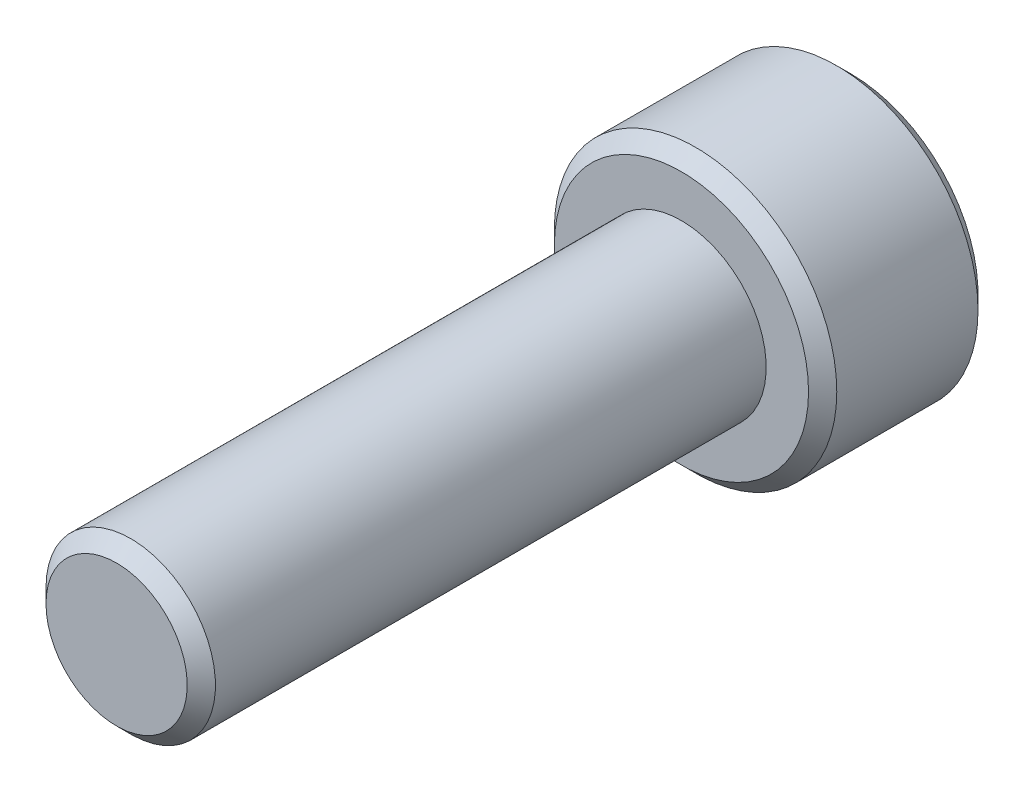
ISO-10303-21;
HEADER;
FILE_DESCRIPTION(('STEP AP214'),'2;1');
FILE_NAME('part.step','',(''),(''),'','','');
FILE_SCHEMA(('AUTOMOTIVE_DESIGN { 1 0 10303 214 1 1 1 1 }'));
ENDSEC;
DATA;
#1=APPLICATION_CONTEXT('core data for automotive mechanical design processes');
#2=APPLICATION_PROTOCOL_DEFINITION('international standard','automotive_design',2000,#1);
#3=PRODUCT_CONTEXT('',#1,'mechanical');
#4=PRODUCT('Part','Part','',(#3));
#5=PRODUCT_RELATED_PRODUCT_CATEGORY('part','',(#4));
#6=PRODUCT_DEFINITION_FORMATION('','',#4);
#7=PRODUCT_DEFINITION_CONTEXT('part definition',#1,'design');
#8=PRODUCT_DEFINITION('design','',#6,#7);
#9=PRODUCT_DEFINITION_SHAPE('','',#8);
#10=(LENGTH_UNIT() NAMED_UNIT(*) SI_UNIT(.MILLI.,.METRE.));
#11=(NAMED_UNIT(*) PLANE_ANGLE_UNIT() SI_UNIT($,.RADIAN.));
#12=(NAMED_UNIT(*) SI_UNIT($,.STERADIAN.) SOLID_ANGLE_UNIT());
#13=UNCERTAINTY_MEASURE_WITH_UNIT(LENGTH_MEASURE(1.E-05),#10,'distance_accuracy_value','');
#14=(GEOMETRIC_REPRESENTATION_CONTEXT(3) GLOBAL_UNCERTAINTY_ASSIGNED_CONTEXT((#13)) GLOBAL_UNIT_ASSIGNED_CONTEXT((#10,
#11,#12)) REPRESENTATION_CONTEXT('',''));
#15=CARTESIAN_POINT('',(0.,0.,0.));
#16=DIRECTION('',(0.,0.,1.));
#17=DIRECTION('',(1.,0.,0.));
#18=AXIS2_PLACEMENT_3D('',#15,#16,#17);
#19=CARTESIAN_POINT('',(-2.5,-1.443375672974,-22.25));
#20=DIRECTION('',(-1.,0.,0.));
#21=DIRECTION('',(0.,0.,1.));
#22=AXIS2_PLACEMENT_3D('',#19,#20,#21);
#23=PLANE('',#22);
#24=DIRECTION('',(0.,1.,0.));
#25=VECTOR('',#24,1.);
#26=CARTESIAN_POINT('',(-2.5,0.,-22.25));
#27=LINE('',#26,#25);
#28=CARTESIAN_POINT('',(-2.49999999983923,1.44337567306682,-22.25));
#29=VERTEX_POINT('',#28);
#30=CARTESIAN_POINT('',(-2.49999999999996,-1.44337567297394,-22.25));
#31=VERTEX_POINT('',#30);
#32=EDGE_CURVE('E172',#29,#31,#27,.F.);
#33=ORIENTED_EDGE('',*,*,#32,.T.);
#34=DIRECTION('',(0.,0.,1.));
#35=VECTOR('',#34,1.);
#36=CARTESIAN_POINT('',(-2.49999999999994,-1.4433756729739,-22.25));
#37=LINE('',#36,#35);
#38=CARTESIAN_POINT('',(-2.4999999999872,-1.44337567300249,-26.0000000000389));
#39=VERTEX_POINT('',#38);
#40=EDGE_CURVE('E275',#31,#39,#37,.F.);
#41=ORIENTED_EDGE('',*,*,#40,.T.);
#42=CARTESIAN_POINT('',(-2.5,1.44337567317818,-26.000000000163));
#43=CARTESIAN_POINT('',(-2.5,1.34480479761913,-25.9507605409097));
#44=CARTESIAN_POINT('',(-2.5,1.2445963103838,-25.904396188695));
#45=CARTESIAN_POINT('',(-2.5,1.04022304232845,-25.8194093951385));
#46=CARTESIAN_POINT('',(-2.5,0.936037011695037,-25.780838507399));
#47=CARTESIAN_POINT('',(-2.5,0.724653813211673,-25.714234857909));
#48=CARTESIAN_POINT('',(-2.5,0.61746818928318,-25.686166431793));
#49=CARTESIAN_POINT('',(-2.5,0.400747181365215,-25.642953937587));
#50=CARTESIAN_POINT('',(-2.5,0.291220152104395,-25.6277699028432));
#51=CARTESIAN_POINT('',(-2.5,0.151078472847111,-25.6176265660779));
#52=CARTESIAN_POINT('',(-2.5,0.12087796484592,-25.6159866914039));
#53=CARTESIAN_POINT('',(-2.5,0.0604529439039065,-25.6137976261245));
#54=CARTESIAN_POINT('',(-2.5,0.0302284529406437,-25.6132478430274));
#55=CARTESIAN_POINT('',(-2.5,-0.0758674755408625,-25.6132506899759));
#56=CARTESIAN_POINT('',(-2.5,-0.15175990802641,-25.616720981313));
#57=CARTESIAN_POINT('',(-2.5,-0.302963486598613,-25.6304110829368));
#58=CARTESIAN_POINT('',(-2.5,-0.378274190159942,-25.6406356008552));
#59=CARTESIAN_POINT('',(-2.5,-0.528122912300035,-25.6673531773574));
#60=CARTESIAN_POINT('',(-2.5,-0.6026557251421,-25.6838750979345));
#61=CARTESIAN_POINT('',(-2.5,-0.750290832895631,-25.7224353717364));
#62=CARTESIAN_POINT('',(-2.5,-0.823392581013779,-25.7444757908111));
#63=CARTESIAN_POINT('',(-2.5,-0.990079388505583,-25.8006905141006));
#64=CARTESIAN_POINT('',(-2.5,-1.08310139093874,-25.8365147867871));
#65=CARTESIAN_POINT('',(-2.5,-1.26562346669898,-25.9141573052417));
#66=CARTESIAN_POINT('',(-2.5,-1.35514797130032,-25.9559177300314));
#67=CARTESIAN_POINT('',(-2.5,-1.44337567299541,-26.0000000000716));
#68=B_SPLINE_CURVE_WITH_KNOTS('',3,(#42,#43,#44,#45,#46,#47,#48,#49,#50,#51,#52,#53,#54,#55,#56,
#57,#58,#59,#60,#61,#62,#63,#64,#65,#66,#67),.UNSPECIFIED.,.F.,.F.,(4,2,2,2,2,2,2,2,2,2,2,2,4),
(0.,0.330782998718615,0.663687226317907,0.995450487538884,1.32618083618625,1.41690228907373,
1.50757441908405,1.73514364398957,1.96287165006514,2.19165617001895,2.42052646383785,
2.71929868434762,3.01533818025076),.UNSPECIFIED.);
#69=CARTESIAN_POINT('',(-2.49999999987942,1.44337567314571,-26.0000000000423));
#70=VERTEX_POINT('',#69);
#71=EDGE_CURVE('E20',#70,#39,#68,.T.);
#72=ORIENTED_EDGE('',*,*,#71,.F.);
#73=DIRECTION('',(0.,0.,1.));
#74=VECTOR('',#73,1.);
#75=CARTESIAN_POINT('',(-2.49999999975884,1.44337567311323,-22.25));
#76=LINE('',#75,#74);
#77=EDGE_CURVE('E81',#70,#29,#76,.T.);
#78=ORIENTED_EDGE('',*,*,#77,.T.);
#79=EDGE_LOOP('',(#33,#41,#72,#78));
#80=FACE_BOUND('',#79,.T.);
#81=ADVANCED_FACE('F16',(#80),#23,.F.);
#82=CARTESIAN_POINT('',(2.5,1.443375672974,-22.25));
#83=DIRECTION('',(1.,0.,0.));
#84=DIRECTION('',(0.,0.,-1.));
#85=AXIS2_PLACEMENT_3D('',#82,#83,#84);
#86=PLANE('',#85);
#87=DIRECTION('',(0.,0.,1.));
#88=VECTOR('',#87,1.);
#89=CARTESIAN_POINT('',(2.49999999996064,-1.44337567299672,-22.25));
#90=LINE('',#89,#88);
#91=CARTESIAN_POINT('',(2.49999999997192,-1.44337567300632,-26.0000000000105));
#92=VERTEX_POINT('',#91);
#93=CARTESIAN_POINT('',(2.49999999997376,-1.44337567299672,-22.25));
#94=VERTEX_POINT('',#93);
#95=EDGE_CURVE('E273',#92,#94,#90,.T.);
#96=ORIENTED_EDGE('',*,*,#95,.T.);
#97=DIRECTION('',(0.,1.,0.));
#98=VECTOR('',#97,1.);
#99=CARTESIAN_POINT('',(2.5,0.,-22.25));
#100=LINE('',#99,#98);
#101=CARTESIAN_POINT('',(2.49999999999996,1.44337567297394,-22.25));
#102=VERTEX_POINT('',#101);
#103=EDGE_CURVE('E175',#94,#102,#100,.T.);
#104=ORIENTED_EDGE('',*,*,#103,.T.);
#105=DIRECTION('',(0.,0.,1.));
#106=VECTOR('',#105,1.);
#107=CARTESIAN_POINT('',(2.49999999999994,1.4433756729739,-22.25));
#108=LINE('',#107,#106);
#109=CARTESIAN_POINT('',(2.49999999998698,1.44337567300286,-26.0000000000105));
#110=VERTEX_POINT('',#109);
#111=EDGE_CURVE('E188',#102,#110,#108,.F.);
#112=ORIENTED_EDGE('',*,*,#111,.T.);
#113=CARTESIAN_POINT('',(2.5,-1.44337567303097,-25.9999999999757));
#114=CARTESIAN_POINT('',(2.5,-1.3448047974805,-25.9507605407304));
#115=CARTESIAN_POINT('',(2.5,-1.24459631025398,-25.9043961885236));
#116=CARTESIAN_POINT('',(2.5,-1.04022304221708,-25.8194093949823));
#117=CARTESIAN_POINT('',(2.5,-0.936037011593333,-25.78083850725));
#118=CARTESIAN_POINT('',(2.5,-0.724653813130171,-25.7142348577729));
#119=CARTESIAN_POINT('',(2.5,-0.617468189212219,-25.6861664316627));
#120=CARTESIAN_POINT('',(2.5,-0.400747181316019,-25.642953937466));
#121=CARTESIAN_POINT('',(2.5,-0.291220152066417,-25.6277699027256));
#122=CARTESIAN_POINT('',(2.5,-0.151078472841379,-25.6176265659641));
#123=CARTESIAN_POINT('',(2.5,-0.120877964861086,-25.6159866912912));
#124=CARTESIAN_POINT('',(2.5,-0.0604529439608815,-25.6137976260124));
#125=CARTESIAN_POINT('',(2.5,-0.0302284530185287,-25.613247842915));
#126=CARTESIAN_POINT('',(2.5,0.0758674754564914,-25.6132506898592));
#127=CARTESIAN_POINT('',(2.5,0.151759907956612,-25.6167209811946));
#128=CARTESIAN_POINT('',(2.5,0.302963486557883,-25.6304110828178));
#129=CARTESIAN_POINT('',(2.5,0.378274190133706,-25.6406356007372));
#130=CARTESIAN_POINT('',(2.5,0.528122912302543,-25.6673531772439));
#131=CARTESIAN_POINT('',(2.5,0.602655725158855,-25.6838750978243));
#132=CARTESIAN_POINT('',(2.5,0.750290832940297,-25.7224353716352));
#133=CARTESIAN_POINT('',(2.5,0.823392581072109,-25.7444757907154));
#134=CARTESIAN_POINT('',(2.5,0.990079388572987,-25.8006905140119));
#135=CARTESIAN_POINT('',(2.5,1.08310139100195,-25.8365147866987));
#136=CARTESIAN_POINT('',(2.5,1.2656234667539,-25.9141573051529));
#137=CARTESIAN_POINT('',(2.5,1.35514797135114,-25.9559177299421));
#138=CARTESIAN_POINT('',(2.5,1.44337567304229,-25.9999999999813));
#139=B_SPLINE_CURVE_WITH_KNOTS('',3,(#113,#114,#115,#116,#117,#118,#119,#120,#121,#122,#123,
#124,#125,#126,#127,#128,#129,#130,#131,#132,#133,#134,#135,#136,#137,#138),.UNSPECIFIED.,.F.,
.F.,(4,2,2,2,2,2,2,2,2,2,2,2,4),(0.,0.330782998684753,0.663687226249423,0.995450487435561,
1.32618083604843,1.41690228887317,1.50757441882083,1.73514364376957,1.96287164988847,
2.19165616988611,2.4205264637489,2.71929868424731,3.0153381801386),.UNSPECIFIED.);
#140=EDGE_CURVE('E40',#92,#110,#139,.T.);
#141=ORIENTED_EDGE('',*,*,#140,.F.);
#142=EDGE_LOOP('',(#96,#104,#112,#141));
#143=FACE_BOUND('',#142,.T.);
#144=ADVANCED_FACE('F164',(#143),#86,.F.);
#145=CARTESIAN_POINT('',(-5.,0.,-22.25));
#146=DIRECTION('',(0.,0.,1.));
#147=DIRECTION('',(1.,0.,0.));
#148=AXIS2_PLACEMENT_3D('',#145,#146,#147);
#149=PLANE('',#148);
#150=DIRECTION('',(0.866025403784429,0.500000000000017,0.));
#151=VECTOR('',#150,1.);
#152=CARTESIAN_POINT('',(2.5,-1.443375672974,-22.25));
#153=LINE('',#152,#151);
#154=CARTESIAN_POINT('',(0.,-2.88675134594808,-22.25));
#155=VERTEX_POINT('',#154);
#156=EDGE_CURVE('E270',#94,#155,#153,.F.);
#157=ORIENTED_EDGE('',*,*,#156,.T.);
#158=DIRECTION('',(0.866025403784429,-0.500000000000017,0.));
#159=VECTOR('',#158,1.);
#160=CARTESIAN_POINT('',(0.,-2.886751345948,-22.25));
#161=LINE('',#160,#159);
#162=EDGE_CURVE('E74',#155,#31,#161,.F.);
#163=ORIENTED_EDGE('',*,*,#162,.T.);
#164=ORIENTED_EDGE('',*,*,#32,.F.);
#165=DIRECTION('',(-0.866025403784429,-0.500000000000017,0.));
#166=VECTOR('',#165,1.);
#167=CARTESIAN_POINT('',(-2.5,1.443375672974,-22.25));
#168=LINE('',#167,#166);
#169=CARTESIAN_POINT('',(0.,2.88675134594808,-22.25));
#170=VERTEX_POINT('',#169);
#171=EDGE_CURVE('E75',#29,#170,#168,.F.);
#172=ORIENTED_EDGE('',*,*,#171,.T.);
#173=DIRECTION('',(-0.866025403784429,0.500000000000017,0.));
#174=VECTOR('',#173,1.);
#175=CARTESIAN_POINT('',(0.,2.886751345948,-22.25));
#176=LINE('',#175,#174);
#177=EDGE_CURVE('E71',#170,#102,#176,.F.);
#178=ORIENTED_EDGE('',*,*,#177,.T.);
#179=ORIENTED_EDGE('',*,*,#103,.F.);
#180=EDGE_LOOP('',(#157,#163,#164,#172,#178,#179));
#181=FACE_BOUND('',#180,.T.);
#182=ADVANCED_FACE('F162',(#181),#149,.F.);
#183=CARTESIAN_POINT('',(0.,2.886751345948,-22.25));
#184=DIRECTION('',(0.500000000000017,0.866025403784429,0.));
#185=DIRECTION('',(-0.866025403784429,0.500000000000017,0.));
#186=AXIS2_PLACEMENT_3D('',#183,#184,#185);
#187=PLANE('',#186);
#188=ORIENTED_EDGE('',*,*,#177,.F.);
#189=DIRECTION('',(0.,0.,1.));
#190=VECTOR('',#189,1.);
#191=CARTESIAN_POINT('',(0.,2.8867513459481,-22.25));
#192=LINE('',#191,#190);
#193=CARTESIAN_POINT('',(1.79944413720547E-12,2.88675134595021,-26.000000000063));
#194=VERTEX_POINT('',#193);
#195=EDGE_CURVE('E62',#170,#194,#192,.F.);
#196=ORIENTED_EDGE('',*,*,#195,.T.);
#197=CARTESIAN_POINT('',(3.59930969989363E-12,2.88675134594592,-26.0000000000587));
#198=CARTESIAN_POINT('',(0.0859262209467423,2.83714181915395,-25.9504380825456));
#199=CARTESIAN_POINT('',(0.173289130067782,2.78670282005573,-25.9037875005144));
#200=CARTESIAN_POINT('',(0.351431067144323,2.68385252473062,-25.8183722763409));
#201=CARTESIAN_POINT('',(0.442227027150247,2.63143145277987,-25.7796551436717));
#202=CARTESIAN_POINT('',(0.625312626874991,2.52572693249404,-25.7133324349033));
#203=CARTESIAN_POINT('',(0.717555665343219,2.47247038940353,-25.6855602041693));
#204=CARTESIAN_POINT('',(0.904071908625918,2.36478518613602,-25.6427717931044));
#205=CARTESIAN_POINT('',(0.998339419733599,2.31035981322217,-25.6277236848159));
#206=CARTESIAN_POINT('',(1.16081381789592,2.21655517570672,-25.614146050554));
#207=CARTESIAN_POINT('',(1.22881095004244,2.17729701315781,-25.6121367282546));
#208=CARTESIAN_POINT('',(1.36469396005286,2.09884492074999,-25.6155262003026));
#209=CARTESIAN_POINT('',(1.43257979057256,2.05965101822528,-25.6209275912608));
#210=CARTESIAN_POINT('',(1.56771033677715,1.98163336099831,-25.6388311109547));
#211=CARTESIAN_POINT('',(1.63495425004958,1.94281006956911,-25.6513411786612));
#212=CARTESIAN_POINT('',(1.76827922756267,1.86583485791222,-25.6827753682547));
#213=CARTESIAN_POINT('',(1.83436038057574,1.82768288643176,-25.7016989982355));
#214=CARTESIAN_POINT('',(2.0035830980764,1.72998210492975,-25.7578643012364));
#215=CARTESIAN_POINT('',(2.10567646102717,1.67103847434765,-25.7993349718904));
#216=CARTESIAN_POINT('',(2.25579690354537,1.5843663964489,-25.8693411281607));
#217=CARTESIAN_POINT('',(2.3052684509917,1.55580398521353,-25.8939377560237));
#218=CARTESIAN_POINT('',(2.40329553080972,1.49920802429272,-25.9453728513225));
#219=CARTESIAN_POINT('',(2.4518516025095,1.47117416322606,-25.9722099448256));
#220=CARTESIAN_POINT('',(2.49999999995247,1.44337567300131,-26.0000000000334));
#221=B_SPLINE_CURVE_WITH_KNOTS('',3,(#197,#198,#199,#200,#201,#202,#203,#204,#205,#206,#207,
#208,#209,#210,#211,#212,#213,#214,#215,#216,#217,#218,#219,#220),.UNSPECIFIED.,.F.,.F.,(4,2,2,
2,2,2,2,2,2,2,2,4),(0.,0.332957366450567,0.667853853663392,0.997433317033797,1.32618330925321,
1.5614759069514,1.79685096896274,2.03248941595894,2.26810979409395,2.64223182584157,
2.82878537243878,3.01522534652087),.UNSPECIFIED.);
#222=EDGE_CURVE('E67',#194,#110,#221,.T.);
#223=ORIENTED_EDGE('',*,*,#222,.T.);
#224=ORIENTED_EDGE('',*,*,#111,.F.);
#225=EDGE_LOOP('',(#188,#196,#223,#224));
#226=FACE_BOUND('',#225,.T.);
#227=ADVANCED_FACE('F64',(#226),#187,.F.);
#228=CARTESIAN_POINT('',(-2.5,1.443375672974,-22.25));
#229=DIRECTION('',(-0.500000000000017,0.866025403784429,0.));
#230=DIRECTION('',(-0.866025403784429,-0.500000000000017,0.));
#231=AXIS2_PLACEMENT_3D('',#228,#229,#230);
#232=PLANE('',#231);
#233=ORIENTED_EDGE('',*,*,#171,.F.);
#234=ORIENTED_EDGE('',*,*,#77,.F.);
#235=CARTESIAN_POINT('',(-2.49999999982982,1.44337567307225,-25.9999999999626));
#236=CARTESIAN_POINT('',(-2.4140737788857,1.49298519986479,-25.9504380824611));
#237=CARTESIAN_POINT('',(-2.32671086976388,1.54342419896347,-25.9037875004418));
#238=CARTESIAN_POINT('',(-2.14856893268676,1.64627449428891,-25.8183722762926));
#239=CARTESIAN_POINT('',(-2.05777297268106,1.69869556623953,-25.7796551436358));
#240=CARTESIAN_POINT('',(-1.87468737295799,1.80440008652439,-25.7133324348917));
#241=CARTESIAN_POINT('',(-1.78244433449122,1.85765662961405,-25.6855602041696));
#242=CARTESIAN_POINT('',(-1.5959280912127,1.96534183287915,-25.6427717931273));
#243=CARTESIAN_POINT('',(-1.50166058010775,2.01976720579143,-25.6277236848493));
#244=CARTESIAN_POINT('',(-1.33918618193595,2.11357184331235,-25.614146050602));
#245=CARTESIAN_POINT('',(-1.27118904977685,2.15283000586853,-25.6121367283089));
#246=CARTESIAN_POINT('',(-1.13530603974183,2.23128209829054,-25.615526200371));
#247=CARTESIAN_POINT('',(-1.06742020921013,2.27047600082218,-25.620927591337));
#248=CARTESIAN_POINT('',(-0.932289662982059,2.34849365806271,-25.6388311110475));
#249=CARTESIAN_POINT('',(-0.865045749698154,2.38731694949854,-25.6513411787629));
#250=CARTESIAN_POINT('',(-0.73172077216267,2.46429216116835,-25.6827753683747));
#251=CARTESIAN_POINT('',(-0.665639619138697,2.5024441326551,-25.7016989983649));
#252=CARTESIAN_POINT('',(-0.496416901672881,2.600144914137,-25.7578643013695));
#253=CARTESIAN_POINT('',(-0.394323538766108,2.6590885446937,-25.7993349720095));
#254=CARTESIAN_POINT('',(-0.244203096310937,2.74576062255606,-25.8693411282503));
#255=CARTESIAN_POINT('',(-0.194731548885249,2.77432303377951,-25.8939377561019));
#256=CARTESIAN_POINT('',(-0.0967044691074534,2.8309189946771,-25.9453728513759));
#257=CARTESIAN_POINT('',(-0.0481483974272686,2.85895285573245,-25.9722099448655));
#258=CARTESIAN_POINT('',(-3.47279370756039E-12,2.88675134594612,-26.0000000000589));
#259=B_SPLINE_CURVE_WITH_KNOTS('',3,(#235,#236,#237,#238,#239,#240,#241,#242,#243,#244,#245,
#246,#247,#248,#249,#250,#251,#252,#253,#254,#255,#256,#257,#258),.UNSPECIFIED.,.F.,.F.,(4,2,2,
2,2,2,2,2,2,2,2,4),(0.,0.332957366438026,0.667853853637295,0.997433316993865,1.32618330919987,
1.56147590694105,1.79685096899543,2.03248941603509,2.26810979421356,2.64223182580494,
2.82878537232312,3.01522534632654),.UNSPECIFIED.);
#260=EDGE_CURVE('E79',#70,#194,#259,.T.);
#261=ORIENTED_EDGE('',*,*,#260,.T.);
#262=ORIENTED_EDGE('',*,*,#195,.F.);
#263=EDGE_LOOP('',(#233,#234,#261,#262));
#264=FACE_BOUND('',#263,.T.);
#265=ADVANCED_FACE('F80',(#264),#232,.F.);
#266=CARTESIAN_POINT('',(0.,-2.886751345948,-22.25));
#267=DIRECTION('',(-0.500000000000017,-0.866025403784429,0.));
#268=DIRECTION('',(0.866025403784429,-0.500000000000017,0.));
#269=AXIS2_PLACEMENT_3D('',#266,#267,#268);
#270=PLANE('',#269);
#271=ORIENTED_EDGE('',*,*,#162,.F.);
#272=DIRECTION('',(0.,0.,1.));
#273=VECTOR('',#272,1.);
#274=CARTESIAN_POINT('',(0.,-2.8867513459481,-22.25));
#275=LINE('',#274,#273);
#276=CARTESIAN_POINT('',(2.46371352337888E-12,-2.88675134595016,-26.000000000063));
#277=VERTEX_POINT('',#276);
#278=EDGE_CURVE('E91',#155,#277,#275,.F.);
#279=ORIENTED_EDGE('',*,*,#278,.T.);
#280=CARTESIAN_POINT('',(-3.10391975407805E-12,-2.88675134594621,-26.000000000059));
#281=CARTESIAN_POINT('',(-0.0859262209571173,-2.83714181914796,-25.9504380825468));
#282=CARTESIAN_POINT('',(-0.173289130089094,-2.78670282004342,-25.9037875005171));
#283=CARTESIAN_POINT('',(-0.351431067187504,-2.68385252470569,-25.8183722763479));
#284=CARTESIAN_POINT('',(-0.442227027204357,-2.63143145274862,-25.7796551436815));
#285=CARTESIAN_POINT('',(-0.625312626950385,-2.52572693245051,-25.7133324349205));
#286=CARTESIAN_POINT('',(-0.717555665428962,-2.47247038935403,-25.685560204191));
#287=CARTESIAN_POINT('',(-0.904071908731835,-2.36478518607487,-25.6427717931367));
#288=CARTESIAN_POINT('',(-0.998339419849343,-2.31035981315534,-25.6277236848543));
#289=CARTESIAN_POINT('',(-1.16081381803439,-2.21655517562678,-25.6141460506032));
#290=CARTESIAN_POINT('',(-1.22881095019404,-2.17729701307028,-25.6121367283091));
#291=CARTESIAN_POINT('',(-1.36469396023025,-2.09884492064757,-25.6155262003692));
#292=CARTESIAN_POINT('',(-1.43257979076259,-2.05965101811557,-25.6209275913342));
#293=CARTESIAN_POINT('',(-1.5677103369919,-1.98163336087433,-25.638831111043));
#294=CARTESIAN_POINT('',(-1.6349542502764,-1.94281006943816,-25.6513411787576));
#295=CARTESIAN_POINT('',(-1.76827922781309,-1.86583485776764,-25.682775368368));
#296=CARTESIAN_POINT('',(-1.83436038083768,-1.82768288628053,-25.7016989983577));
#297=CARTESIAN_POINT('',(-2.00358309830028,-1.7299821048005,-25.7578643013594));
#298=CARTESIAN_POINT('',(-2.10567646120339,-1.67103847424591,-25.7993349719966));
#299=CARTESIAN_POINT('',(-2.25579690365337,-1.58436639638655,-25.8693411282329));
#300=CARTESIAN_POINT('',(-2.30526845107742,-1.55580398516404,-25.893937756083));
#301=CARTESIAN_POINT('',(-2.40329553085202,-1.4992080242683,-25.9453728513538));
#302=CARTESIAN_POINT('',(-2.45185160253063,-1.47117416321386,-25.9722099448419));
#303=CARTESIAN_POINT('',(-2.49999999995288,-1.44337567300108,-26.0000000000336));
#304=B_SPLINE_CURVE_WITH_KNOTS('',3,(#280,#281,#282,#283,#284,#285,#286,#287,#288,#289,#290,
#291,#292,#293,#294,#295,#296,#297,#298,#299,#300,#301,#302,#303),.UNSPECIFIED.,.F.,.F.,(4,2,2,
2,2,2,2,2,2,2,2,4),(0.,0.332957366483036,0.667853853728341,0.99743331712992,1.32618330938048,
1.56147590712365,1.79685096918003,2.03248941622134,2.26810979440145,2.6422318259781,
2.82878537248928,3.01522534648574),.UNSPECIFIED.);
#305=EDGE_CURVE('E85',#277,#39,#304,.T.);
#306=ORIENTED_EDGE('',*,*,#305,.T.);
#307=ORIENTED_EDGE('',*,*,#40,.F.);
#308=EDGE_LOOP('',(#271,#279,#306,#307));
#309=FACE_BOUND('',#308,.T.);
#310=ADVANCED_FACE('F157',(#309),#270,.F.);
#311=CARTESIAN_POINT('',(2.5,-1.443375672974,-22.25));
#312=DIRECTION('',(0.500000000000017,-0.866025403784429,0.));
#313=DIRECTION('',(0.866025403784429,0.500000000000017,0.));
#314=AXIS2_PLACEMENT_3D('',#311,#312,#313);
#315=PLANE('',#314);
#316=ORIENTED_EDGE('',*,*,#156,.F.);
#317=ORIENTED_EDGE('',*,*,#95,.F.);
#318=CARTESIAN_POINT('',(2.49999999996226,-1.44337567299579,-26.0000000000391));
#319=CARTESIAN_POINT('',(2.41407377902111,-1.49298519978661,-25.9504380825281));
#320=CARTESIAN_POINT('',(2.32671086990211,-1.54342419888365,-25.903787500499));
#321=CARTESIAN_POINT('',(2.14856893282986,-1.64627449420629,-25.8183722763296));
#322=CARTESIAN_POINT('',(2.05777297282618,-1.69869556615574,-25.7796551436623));
#323=CARTESIAN_POINT('',(1.87468737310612,-1.80440008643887,-25.7133324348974));
#324=CARTESIAN_POINT('',(1.78244433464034,-1.85765662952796,-25.6855602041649));
#325=CARTESIAN_POINT('',(1.59592809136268,-1.96534183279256,-25.6427717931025));
#326=CARTESIAN_POINT('',(1.5016605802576,-2.01976720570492,-25.6277236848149));
#327=CARTESIAN_POINT('',(1.33918618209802,-2.11357184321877,-25.6141460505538));
#328=CARTESIAN_POINT('',(1.27118904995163,-2.15283000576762,-25.6121367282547));
#329=CARTESIAN_POINT('',(1.13530603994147,-2.23128209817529,-25.6155262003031));
#330=CARTESIAN_POINT('',(1.06742020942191,-2.27047600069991,-25.6209275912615));
#331=CARTESIAN_POINT('',(0.932289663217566,-2.34849365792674,-25.6388311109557));
#332=CARTESIAN_POINT('',(0.865045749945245,-2.38731694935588,-25.6513411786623));
#333=CARTESIAN_POINT('',(0.731720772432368,-2.46429216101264,-25.6827753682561));
#334=CARTESIAN_POINT('',(0.665639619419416,-2.50244413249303,-25.7016989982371));
#335=CARTESIAN_POINT('',(0.496416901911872,-2.60014491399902,-25.7578643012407));
#336=CARTESIAN_POINT('',(0.394323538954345,-2.65908854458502,-25.7993349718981));
#337=CARTESIAN_POINT('',(0.244203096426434,-2.74576062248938,-25.8693411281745));
#338=CARTESIAN_POINT('',(0.194731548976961,-2.77432303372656,-25.8939377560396));
#339=CARTESIAN_POINT('',(0.0967044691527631,-2.83091899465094,-25.9453728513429));
#340=CARTESIAN_POINT('',(0.048148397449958,-2.85895285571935,-25.9722099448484));
#341=CARTESIAN_POINT('',(3.9981934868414E-12,-2.88675134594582,-26.0000000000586));
#342=B_SPLINE_CURVE_WITH_KNOTS('',3,(#318,#319,#320,#321,#322,#323,#324,#325,#326,#327,#328,
#329,#330,#331,#332,#333,#334,#335,#336,#337,#338,#339,#340,#341),.UNSPECIFIED.,.F.,.F.,(4,2,2,
2,2,2,2,2,2,2,2,4),(0.,0.332957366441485,0.667853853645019,0.997433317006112,1.32618330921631,
1.56147590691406,1.79685096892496,2.03248941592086,2.2681097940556,2.6422318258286,
2.82878537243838,3.01522534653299),.UNSPECIFIED.);
#343=EDGE_CURVE('E105',#92,#277,#342,.T.);
#344=ORIENTED_EDGE('',*,*,#343,.T.);
#345=ORIENTED_EDGE('',*,*,#278,.F.);
#346=EDGE_LOOP('',(#316,#317,#344,#345));
#347=FACE_BOUND('',#346,.T.);
#348=ADVANCED_FACE('F123',(#347),#315,.F.);
#349=CARTESIAN_POINT('',(0.,0.,-25.9999999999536));
#350=DIRECTION('',(0.,0.,-1.));
#351=DIRECTION('',(-1.,0.,0.));
#352=AXIS2_PLACEMENT_3D('',#349,#350,#351);
#353=CONICAL_SURFACE('',#352,2.88675134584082,0.785398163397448);
#354=ORIENTED_EDGE('',*,*,#222,.F.);
#355=CARTESIAN_POINT('',(0.,0.,-26.0000000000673));
#356=DIRECTION('',(0.,0.,-1.));
#357=DIRECTION('',(-1.,0.,0.));
#358=AXIS2_PLACEMENT_3D('',#355,#356,#357);
#359=CIRCLE('',#358,2.88675134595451);
#360=EDGE_CURVE('E90',#110,#194,#359,.F.);
#361=ORIENTED_EDGE('',*,*,#360,.F.);
#362=EDGE_LOOP('',(#354,#361));
#363=FACE_BOUND('',#362,.T.);
#364=ADVANCED_FACE('F88',(#363),#353,.F.);
#365=CARTESIAN_POINT('',(0.,0.,-25.9999999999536));
#366=DIRECTION('',(0.,0.,-1.));
#367=DIRECTION('',(-1.,0.,0.));
#368=AXIS2_PLACEMENT_3D('',#365,#366,#367);
#369=CONICAL_SURFACE('',#368,2.88675134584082,0.785398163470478);
#370=ORIENTED_EDGE('',*,*,#260,.F.);
#371=CARTESIAN_POINT('',(0.,0.,-26.0000000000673));
#372=DIRECTION('',(0.,0.,-1.));
#373=DIRECTION('',(-1.,0.,0.));
#374=AXIS2_PLACEMENT_3D('',#371,#372,#373);
#375=CIRCLE('',#374,2.88675134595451);
#376=EDGE_CURVE('E93',#194,#70,#375,.F.);
#377=ORIENTED_EDGE('',*,*,#376,.F.);
#378=EDGE_LOOP('',(#370,#377));
#379=FACE_BOUND('',#378,.T.);
#380=ADVANCED_FACE('F94',(#379),#369,.F.);
#381=CARTESIAN_POINT('',(0.,0.,-26.0000000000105));
#382=DIRECTION('',(0.,0.,-1.));
#383=DIRECTION('',(-1.,0.,0.));
#384=AXIS2_PLACEMENT_3D('',#381,#382,#383);
#385=CONICAL_SURFACE('',#384,2.88675134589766,0.785398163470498);
#386=CARTESIAN_POINT('',(0.,0.,-26.0000000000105));
#387=DIRECTION('',(0.,0.,-1.));
#388=DIRECTION('',(-1.,0.,0.));
#389=AXIS2_PLACEMENT_3D('',#386,#387,#388);
#390=CIRCLE('',#389,2.88675134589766);
#391=EDGE_CURVE('E97',#70,#39,#390,.F.);
#392=ORIENTED_EDGE('',*,*,#391,.F.);
#393=ORIENTED_EDGE('',*,*,#71,.T.);
#394=EDGE_LOOP('',(#392,#393));
#395=FACE_BOUND('',#394,.T.);
#396=ADVANCED_FACE('F137',(#395),#385,.F.);
#397=CARTESIAN_POINT('',(0.,0.,-25.9999999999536));
#398=DIRECTION('',(0.,0.,-1.));
#399=DIRECTION('',(-1.,0.,0.));
#400=AXIS2_PLACEMENT_3D('',#397,#398,#399);
#401=CONICAL_SURFACE('',#400,2.88675134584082,0.785398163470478);
#402=ORIENTED_EDGE('',*,*,#305,.F.);
#403=CARTESIAN_POINT('',(0.,0.,-26.0000000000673));
#404=DIRECTION('',(0.,0.,-1.));
#405=DIRECTION('',(-1.,0.,0.));
#406=AXIS2_PLACEMENT_3D('',#403,#404,#405);
#407=CIRCLE('',#406,2.88675134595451);
#408=EDGE_CURVE('E211',#39,#277,#407,.F.);
#409=ORIENTED_EDGE('',*,*,#408,.F.);
#410=EDGE_LOOP('',(#402,#409));
#411=FACE_BOUND('',#410,.T.);
#412=ADVANCED_FACE('F131',(#411),#401,.F.);
#413=CARTESIAN_POINT('',(0.,0.,-25.9999999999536));
#414=DIRECTION('',(0.,0.,-1.));
#415=DIRECTION('',(-1.,0.,0.));
#416=AXIS2_PLACEMENT_3D('',#413,#414,#415);
#417=CONICAL_SURFACE('',#416,2.88675134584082,0.785398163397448);
#418=ORIENTED_EDGE('',*,*,#343,.F.);
#419=CARTESIAN_POINT('',(0.,0.,-26.0000000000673));
#420=DIRECTION('',(0.,0.,-1.));
#421=DIRECTION('',(-1.,0.,0.));
#422=AXIS2_PLACEMENT_3D('',#419,#420,#421);
#423=CIRCLE('',#422,2.88675134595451);
#424=EDGE_CURVE('E209',#277,#92,#423,.F.);
#425=ORIENTED_EDGE('',*,*,#424,.F.);
#426=EDGE_LOOP('',(#418,#425));
#427=FACE_BOUND('',#426,.T.);
#428=ADVANCED_FACE('F126',(#427),#417,.F.);
#429=CARTESIAN_POINT('',(0.,0.,-25.9999999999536));
#430=DIRECTION('',(0.,0.,-1.));
#431=DIRECTION('',(-1.,0.,0.));
#432=AXIS2_PLACEMENT_3D('',#429,#430,#431);
#433=CONICAL_SURFACE('',#432,2.88675134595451,0.785398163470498);
#434=ORIENTED_EDGE('',*,*,#140,.T.);
#435=CARTESIAN_POINT('',(0.,0.,-25.9999999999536));
#436=DIRECTION('',(0.,0.,-1.));
#437=DIRECTION('',(-1.,0.,0.));
#438=AXIS2_PLACEMENT_3D('',#435,#436,#437);
#439=CIRCLE('',#438,2.88675134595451);
#440=EDGE_CURVE('E104',#92,#110,#439,.F.);
#441=ORIENTED_EDGE('',*,*,#440,.F.);
#442=EDGE_LOOP('',(#434,#441));
#443=FACE_BOUND('',#442,.T.);
#444=ADVANCED_FACE('F130',(#443),#433,.F.);
#445=CARTESIAN_POINT('',(0.,0.,-26.));
#446=DIRECTION('',(0.,0.,-1.));
#447=DIRECTION('',(-1.,0.,0.));
#448=AXIS2_PLACEMENT_3D('',#445,#446,#447);
#449=PLANE('',#448);
#450=ORIENTED_EDGE('',*,*,#424,.T.);
#451=ORIENTED_EDGE('',*,*,#440,.T.);
#452=ORIENTED_EDGE('',*,*,#360,.T.);
#453=ORIENTED_EDGE('',*,*,#376,.T.);
#454=ORIENTED_EDGE('',*,*,#391,.T.);
#455=ORIENTED_EDGE('',*,*,#408,.T.);
#456=EDGE_LOOP('',(#450,#451,#452,#453,#454,#455));
#457=FACE_BOUND('',#456,.T.);
#458=CARTESIAN_POINT('',(0.,0.,-26.0000000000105));
#459=DIRECTION('',(0.,0.,1.));
#460=DIRECTION('',(0.,-1.,0.));
#461=AXIS2_PLACEMENT_3D('',#458,#459,#460);
#462=CIRCLE('',#461,4.50000000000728);
#463=CARTESIAN_POINT('',(0.,-4.50000000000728,-26.0000000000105));
#464=VERTEX_POINT('',#463);
#465=EDGE_CURVE('E204',#464,#464,#462,.T.);
#466=ORIENTED_EDGE('',*,*,#465,.F.);
#467=EDGE_LOOP('',(#466));
#468=FACE_BOUND('',#467,.T.);
#469=ADVANCED_FACE('F101',(#457,#468),#449,.T.);
#470=CARTESIAN_POINT('',(0.,0.,-25.500000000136));
#471=DIRECTION('',(0.,0.,1.));
#472=DIRECTION('',(0.,-1.,0.));
#473=AXIS2_PLACEMENT_3D('',#470,#471,#472);
#474=CONICAL_SURFACE('',#473,4.99999999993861,0.785398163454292);
#475=CARTESIAN_POINT('',(0.,0.,-25.50000000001));
#476=DIRECTION('',(0.,0.,1.));
#477=DIRECTION('',(1.,0.,0.));
#478=AXIS2_PLACEMENT_3D('',#475,#476,#477);
#479=CIRCLE('',#478,5.);
#480=CARTESIAN_POINT('',(5.,0.,-25.50000000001));
#481=VERTEX_POINT('',#480);
#482=EDGE_CURVE('E207',#481,#481,#479,.T.);
#483=ORIENTED_EDGE('',*,*,#482,.F.);
#484=EDGE_LOOP('',(#483));
#485=FACE_BOUND('',#484,.T.);
#486=ORIENTED_EDGE('',*,*,#465,.T.);
#487=EDGE_LOOP('',(#486));
#488=FACE_BOUND('',#487,.T.);
#489=ADVANCED_FACE('F227',(#485,#488),#474,.T.);
#490=CARTESIAN_POINT('',(0.,0.,-26.));
#491=DIRECTION('',(0.,0.,1.));
#492=DIRECTION('',(1.,0.,0.));
#493=AXIS2_PLACEMENT_3D('',#490,#491,#492);
#494=CYLINDRICAL_SURFACE('',#493,5.);
#495=CARTESIAN_POINT('',(0.,0.,-20.5000000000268));
#496=DIRECTION('',(0.,0.,-1.));
#497=DIRECTION('',(-1.,0.,0.));
#498=AXIS2_PLACEMENT_3D('',#495,#496,#497);
#499=CIRCLE('',#498,4.99999999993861);
#500=CARTESIAN_POINT('',(-4.99999999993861,0.,-20.5000000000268));
#501=VERTEX_POINT('',#500);
#502=EDGE_CURVE('E203',#501,#501,#499,.F.);
#503=ORIENTED_EDGE('',*,*,#502,.F.);
#504=EDGE_LOOP('',(#503));
#505=FACE_BOUND('',#504,.T.);
#506=ORIENTED_EDGE('',*,*,#482,.T.);
#507=EDGE_LOOP('',(#506));
#508=FACE_BOUND('',#507,.T.);
#509=ADVANCED_FACE('F251',(#505,#508),#494,.T.);
#510=CARTESIAN_POINT('',(0.,0.,-20.49999999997));
#511=DIRECTION('',(0.,0.,-1.));
#512=DIRECTION('',(-1.,0.,0.));
#513=AXIS2_PLACEMENT_3D('',#510,#511,#512);
#514=CONICAL_SURFACE('',#513,4.99999999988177,0.785398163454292);
#515=ORIENTED_EDGE('',*,*,#502,.T.);
#516=EDGE_LOOP('',(#515));
#517=FACE_BOUND('',#516,.T.);
#518=CARTESIAN_POINT('',(0.,0.,-20.0000000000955));
#519=DIRECTION('',(0.,0.,-1.));
#520=DIRECTION('',(-1.,0.,0.));
#521=AXIS2_PLACEMENT_3D('',#518,#519,#520);
#522=CIRCLE('',#521,4.49999999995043);
#523=CARTESIAN_POINT('',(-4.49999999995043,0.,-20.0000000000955));
#524=VERTEX_POINT('',#523);
#525=EDGE_CURVE('E200',#524,#524,#522,.F.);
#526=ORIENTED_EDGE('',*,*,#525,.F.);
#527=EDGE_LOOP('',(#526));
#528=FACE_BOUND('',#527,.T.);
#529=ADVANCED_FACE('F247',(#517,#528),#514,.T.);
#530=CARTESIAN_POINT('',(0.,0.,-3.865310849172E-11));
#531=DIRECTION('',(0.,0.,1.));
#532=DIRECTION('',(1.,0.,0.));
#533=AXIS2_PLACEMENT_3D('',#530,#531,#532);
#534=PLANE('',#533);
#535=CARTESIAN_POINT('',(0.,0.,0.));
#536=DIRECTION('',(0.,0.,-1.));
#537=DIRECTION('',(-1.,0.,0.));
#538=AXIS2_PLACEMENT_3D('',#535,#536,#537);
#539=CIRCLE('',#538,2.49999999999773);
#540=CARTESIAN_POINT('',(-2.49999999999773,0.,0.));
#541=VERTEX_POINT('',#540);
#542=EDGE_CURVE('E197',#541,#541,#539,.T.);
#543=ORIENTED_EDGE('',*,*,#542,.F.);
#544=EDGE_LOOP('',(#543));
#545=FACE_BOUND('',#544,.T.);
#546=ADVANCED_FACE('F243',(#545),#534,.T.);
#547=CARTESIAN_POINT('',(-4.49999999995,0.,-20.00000000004));
#548=DIRECTION('',(0.,0.,1.));
#549=DIRECTION('',(1.,0.,0.));
#550=AXIS2_PLACEMENT_3D('',#547,#548,#549);
#551=PLANE('',#550);
#552=CARTESIAN_POINT('',(0.,0.,-20.00000000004));
#553=DIRECTION('',(0.,0.,-1.));
#554=DIRECTION('',(-1.,0.,0.));
#555=AXIS2_PLACEMENT_3D('',#552,#553,#554);
#556=CIRCLE('',#555,3.);
#557=CARTESIAN_POINT('',(-3.,0.,-20.00000000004));
#558=VERTEX_POINT('',#557);
#559=EDGE_CURVE('E31',#558,#558,#556,.F.);
#560=ORIENTED_EDGE('',*,*,#559,.F.);
#561=EDGE_LOOP('',(#560));
#562=FACE_BOUND('',#561,.T.);
#563=ORIENTED_EDGE('',*,*,#525,.T.);
#564=EDGE_LOOP('',(#563));
#565=FACE_BOUND('',#564,.T.);
#566=ADVANCED_FACE('F236',(#562,#565),#551,.T.);
#567=CARTESIAN_POINT('',(0.,0.,-0.499999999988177));
#568=DIRECTION('',(0.,0.,-1.));
#569=DIRECTION('',(-1.,0.,0.));
#570=AXIS2_PLACEMENT_3D('',#567,#568,#569);
#571=CONICAL_SURFACE('',#570,2.9999999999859,0.785398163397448);
#572=CARTESIAN_POINT('',(0.,0.,-0.5000000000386));
#573=DIRECTION('',(0.,0.,-1.));
#574=DIRECTION('',(-1.,0.,0.));
#575=AXIS2_PLACEMENT_3D('',#572,#573,#574);
#576=CIRCLE('',#575,3.);
#577=CARTESIAN_POINT('',(-3.,0.,-0.5000000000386));
#578=VERTEX_POINT('',#577);
#579=EDGE_CURVE('E11',#578,#578,#576,.T.);
#580=ORIENTED_EDGE('',*,*,#579,.F.);
#581=EDGE_LOOP('',(#580));
#582=FACE_BOUND('',#581,.T.);
#583=ORIENTED_EDGE('',*,*,#542,.T.);
#584=EDGE_LOOP('',(#583));
#585=FACE_BOUND('',#584,.T.);
#586=ADVANCED_FACE('F230',(#582,#585),#571,.T.);
#587=CARTESIAN_POINT('',(0.,0.,-3.865310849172E-11));
#588=DIRECTION('',(0.,0.,-1.));
#589=DIRECTION('',(-1.,0.,0.));
#590=AXIS2_PLACEMENT_3D('',#587,#588,#589);
#591=CYLINDRICAL_SURFACE('',#590,3.);
#592=ORIENTED_EDGE('',*,*,#559,.T.);
#593=EDGE_LOOP('',(#592));
#594=FACE_BOUND('',#593,.T.);
#595=ORIENTED_EDGE('',*,*,#579,.T.);
#596=EDGE_LOOP('',(#595));
#597=FACE_BOUND('',#596,.T.);
#598=ADVANCED_FACE('F228',(#594,#597),#591,.T.);
#599=CLOSED_SHELL('',(#81,#144,#182,#227,#265,#310,#348,#364,#380,#396,#412,#428,#444,#469,#489,
#509,#529,#546,#566,#586,#598));
#600=MANIFOLD_SOLID_BREP('B1',#599);
#601=ADVANCED_BREP_SHAPE_REPRESENTATION('',(#18,#600),#14);
#602=SHAPE_DEFINITION_REPRESENTATION(#9,#601);
ENDSEC;
END-ISO-10303-21;
